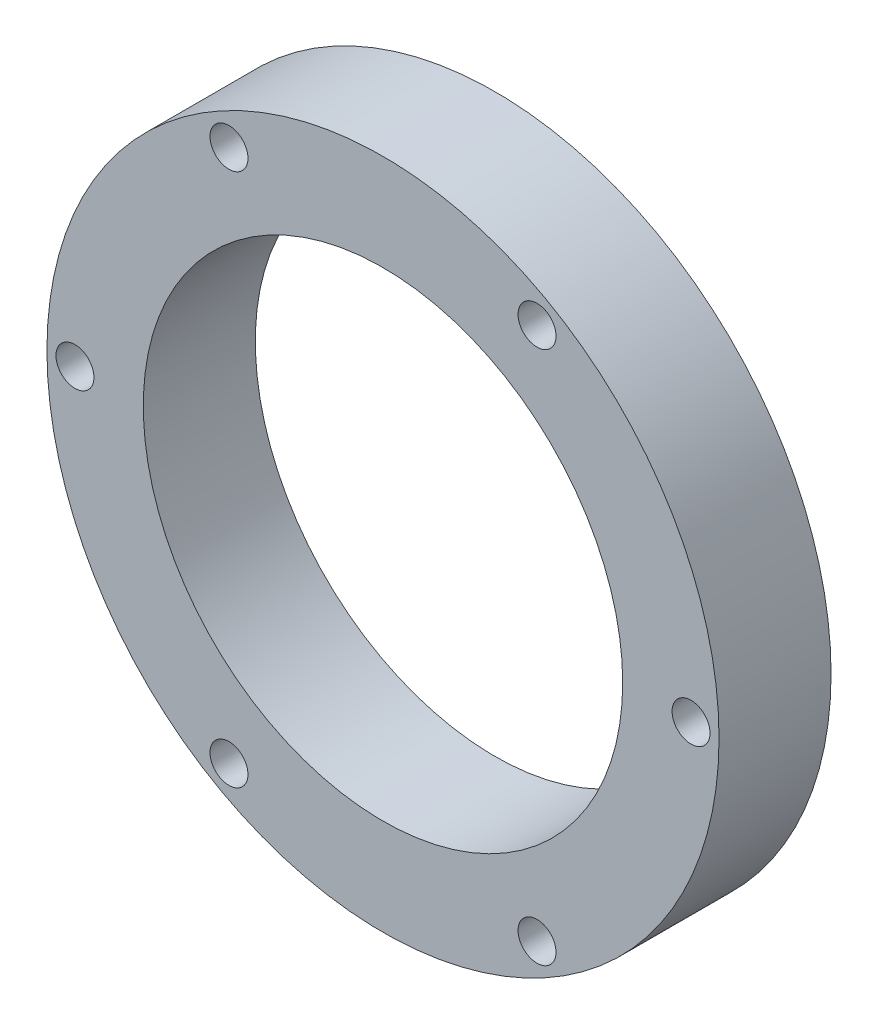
ISO-10303-21;
HEADER;
FILE_DESCRIPTION(('STEP AP214'),'2;1');
FILE_NAME('part.step','',(''),(''),'','','');
FILE_SCHEMA(('AUTOMOTIVE_DESIGN { 1 0 10303 214 1 1 1 1 }'));
ENDSEC;
DATA;
#1=APPLICATION_CONTEXT('core data for automotive mechanical design processes');
#2=APPLICATION_PROTOCOL_DEFINITION('international standard','automotive_design',2000,#1);
#3=PRODUCT_CONTEXT('',#1,'mechanical');
#4=PRODUCT('Part','Part','',(#3));
#5=PRODUCT_RELATED_PRODUCT_CATEGORY('part','',(#4));
#6=PRODUCT_DEFINITION_FORMATION('','',#4);
#7=PRODUCT_DEFINITION_CONTEXT('part definition',#1,'design');
#8=PRODUCT_DEFINITION('design','',#6,#7);
#9=PRODUCT_DEFINITION_SHAPE('','',#8);
#10=(LENGTH_UNIT() NAMED_UNIT(*) SI_UNIT(.MILLI.,.METRE.));
#11=(NAMED_UNIT(*) PLANE_ANGLE_UNIT() SI_UNIT($,.RADIAN.));
#12=(NAMED_UNIT(*) SI_UNIT($,.STERADIAN.) SOLID_ANGLE_UNIT());
#13=UNCERTAINTY_MEASURE_WITH_UNIT(LENGTH_MEASURE(1.E-05),#10,'distance_accuracy_value','');
#14=(GEOMETRIC_REPRESENTATION_CONTEXT(3) GLOBAL_UNCERTAINTY_ASSIGNED_CONTEXT((#13)) GLOBAL_UNIT_ASSIGNED_CONTEXT((#10,
#11,#12)) REPRESENTATION_CONTEXT('',''));
#15=CARTESIAN_POINT('',(0.,0.,0.));
#16=DIRECTION('',(0.,0.,1.));
#17=DIRECTION('',(1.,0.,0.));
#18=AXIS2_PLACEMENT_3D('',#15,#16,#17);
#19=CARTESIAN_POINT('',(0.,0.,0.));
#20=DIRECTION('',(0.,0.,1.));
#21=DIRECTION('',(1.,0.,0.));
#22=AXIS2_PLACEMENT_3D('',#19,#20,#21);
#23=PLANE('',#22);
#24=CARTESIAN_POINT('',(0.,0.,0.));
#25=DIRECTION('',(0.,0.,1.));
#26=DIRECTION('',(1.,0.,0.));
#27=AXIS2_PLACEMENT_3D('',#24,#25,#26);
#28=CIRCLE('',#27,27.178);
#29=CARTESIAN_POINT('',(27.178,0.,0.));
#30=VERTEX_POINT('',#29);
#31=EDGE_CURVE('E52',#30,#30,#28,.T.);
#32=ORIENTED_EDGE('',*,*,#31,.T.);
#33=EDGE_LOOP('',(#32));
#34=FACE_BOUND('',#33,.T.);
#35=CARTESIAN_POINT('',(0.,0.,0.));
#36=DIRECTION('',(0.,0.,-1.));
#37=DIRECTION('',(-1.,0.,0.));
#38=AXIS2_PLACEMENT_3D('',#35,#36,#37);
#39=CIRCLE('',#38,29.1592);
#40=CARTESIAN_POINT('',(-29.1592,0.,0.));
#41=VERTEX_POINT('',#40);
#42=EDGE_CURVE('E116',#41,#41,#39,.T.);
#43=ORIENTED_EDGE('',*,*,#42,.T.);
#44=EDGE_LOOP('',(#43));
#45=FACE_BOUND('',#44,.T.);
#46=ADVANCED_FACE('F37',(#34,#45),#23,.F.);
#47=CARTESIAN_POINT('',(0.,0.,12.7));
#48=DIRECTION('',(0.,0.,1.));
#49=DIRECTION('',(1.,0.,0.));
#50=AXIS2_PLACEMENT_3D('',#47,#48,#49);
#51=PLANE('',#50);
#52=CARTESIAN_POINT('',(-34.925,0.,12.7));
#53=DIRECTION('',(0.,0.,1.));
#54=DIRECTION('',(1.,0.,0.));
#55=AXIS2_PLACEMENT_3D('',#52,#53,#54);
#56=CIRCLE('',#55,2.15265);
#57=CARTESIAN_POINT('',(-32.77235,0.,12.7));
#58=VERTEX_POINT('',#57);
#59=EDGE_CURVE('E103',#58,#58,#56,.T.);
#60=ORIENTED_EDGE('',*,*,#59,.F.);
#61=EDGE_LOOP('',(#60));
#62=FACE_BOUND('',#61,.T.);
#63=CARTESIAN_POINT('',(-17.4625,30.2459372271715,12.7));
#64=DIRECTION('',(0.,0.,1.));
#65=DIRECTION('',(1.,0.,0.));
#66=AXIS2_PLACEMENT_3D('',#63,#64,#65);
#67=CIRCLE('',#66,2.15265);
#68=CARTESIAN_POINT('',(-15.30985,30.2459372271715,12.7));
#69=VERTEX_POINT('',#68);
#70=EDGE_CURVE('E95',#69,#69,#67,.T.);
#71=ORIENTED_EDGE('',*,*,#70,.F.);
#72=EDGE_LOOP('',(#71));
#73=FACE_BOUND('',#72,.T.);
#74=CARTESIAN_POINT('',(17.4625,30.2459372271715,12.7));
#75=DIRECTION('',(0.,0.,1.));
#76=DIRECTION('',(1.,0.,0.));
#77=AXIS2_PLACEMENT_3D('',#74,#75,#76);
#78=CIRCLE('',#77,2.15265);
#79=CARTESIAN_POINT('',(19.61515,30.2459372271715,12.7));
#80=VERTEX_POINT('',#79);
#81=EDGE_CURVE('E87',#80,#80,#78,.T.);
#82=ORIENTED_EDGE('',*,*,#81,.F.);
#83=EDGE_LOOP('',(#82));
#84=FACE_BOUND('',#83,.T.);
#85=CARTESIAN_POINT('',(34.925,0.,12.7));
#86=DIRECTION('',(0.,0.,1.));
#87=DIRECTION('',(1.,0.,0.));
#88=AXIS2_PLACEMENT_3D('',#85,#86,#87);
#89=CIRCLE('',#88,2.15265);
#90=CARTESIAN_POINT('',(37.07765,0.,12.7));
#91=VERTEX_POINT('',#90);
#92=EDGE_CURVE('E79',#91,#91,#89,.T.);
#93=ORIENTED_EDGE('',*,*,#92,.F.);
#94=EDGE_LOOP('',(#93));
#95=FACE_BOUND('',#94,.T.);
#96=CARTESIAN_POINT('',(17.4625,-30.2459372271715,12.7));
#97=DIRECTION('',(0.,0.,1.));
#98=DIRECTION('',(1.,0.,0.));
#99=AXIS2_PLACEMENT_3D('',#96,#97,#98);
#100=CIRCLE('',#99,2.15265);
#101=CARTESIAN_POINT('',(19.61515,-30.2459372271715,12.7));
#102=VERTEX_POINT('',#101);
#103=EDGE_CURVE('E71',#102,#102,#100,.T.);
#104=ORIENTED_EDGE('',*,*,#103,.F.);
#105=EDGE_LOOP('',(#104));
#106=FACE_BOUND('',#105,.T.);
#107=CARTESIAN_POINT('',(-17.4625,-30.2459372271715,12.7));
#108=DIRECTION('',(0.,0.,1.));
#109=DIRECTION('',(1.,0.,0.));
#110=AXIS2_PLACEMENT_3D('',#107,#108,#109);
#111=CIRCLE('',#110,2.15265);
#112=CARTESIAN_POINT('',(-15.30985,-30.2459372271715,12.7));
#113=VERTEX_POINT('',#112);
#114=EDGE_CURVE('E63',#113,#113,#111,.T.);
#115=ORIENTED_EDGE('',*,*,#114,.F.);
#116=EDGE_LOOP('',(#115));
#117=FACE_BOUND('',#116,.T.);
#118=CARTESIAN_POINT('',(0.,0.,12.7));
#119=DIRECTION('',(0.,0.,1.));
#120=DIRECTION('',(1.,0.,0.));
#121=AXIS2_PLACEMENT_3D('',#118,#119,#120);
#122=CIRCLE('',#121,38.1);
#123=CARTESIAN_POINT('',(38.1,0.,12.7));
#124=VERTEX_POINT('',#123);
#125=EDGE_CURVE('E10',#124,#124,#122,.T.);
#126=ORIENTED_EDGE('',*,*,#125,.T.);
#127=EDGE_LOOP('',(#126));
#128=FACE_BOUND('',#127,.T.);
#129=CARTESIAN_POINT('',(0.,0.,12.7));
#130=DIRECTION('',(0.,0.,1.));
#131=DIRECTION('',(1.,0.,0.));
#132=AXIS2_PLACEMENT_3D('',#129,#130,#131);
#133=CIRCLE('',#132,27.178);
#134=CARTESIAN_POINT('',(27.178,0.,12.7));
#135=VERTEX_POINT('',#134);
#136=EDGE_CURVE('E50',#135,#135,#133,.T.);
#137=ORIENTED_EDGE('',*,*,#136,.F.);
#138=EDGE_LOOP('',(#137));
#139=FACE_BOUND('',#138,.T.);
#140=ADVANCED_FACE('F143',(#62,#73,#84,#95,#106,#117,#128,#139),#51,.T.);
#141=CARTESIAN_POINT('',(0.,0.,0.));
#142=DIRECTION('',(0.,0.,-1.));
#143=DIRECTION('',(-1.,0.,0.));
#144=AXIS2_PLACEMENT_3D('',#141,#142,#143);
#145=CIRCLE('',#144,31.8008);
#146=CARTESIAN_POINT('',(-31.8008,0.,0.));
#147=VERTEX_POINT('',#146);
#148=EDGE_CURVE('E108',#147,#147,#145,.T.);
#149=ORIENTED_EDGE('',*,*,#148,.F.);
#150=EDGE_LOOP('',(#149));
#151=FACE_BOUND('',#150,.T.);
#152=CARTESIAN_POINT('',(-34.925,0.,0.));
#153=DIRECTION('',(0.,0.,1.));
#154=DIRECTION('',(1.,0.,0.));
#155=AXIS2_PLACEMENT_3D('',#152,#153,#154);
#156=CIRCLE('',#155,2.15265);
#157=CARTESIAN_POINT('',(-32.77235,0.,0.));
#158=VERTEX_POINT('',#157);
#159=EDGE_CURVE('E99',#158,#158,#156,.T.);
#160=ORIENTED_EDGE('',*,*,#159,.T.);
#161=EDGE_LOOP('',(#160));
#162=FACE_BOUND('',#161,.T.);
#163=CARTESIAN_POINT('',(-17.4625,30.2459372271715,0.));
#164=DIRECTION('',(0.,0.,1.));
#165=DIRECTION('',(1.,0.,0.));
#166=AXIS2_PLACEMENT_3D('',#163,#164,#165);
#167=CIRCLE('',#166,2.15265);
#168=CARTESIAN_POINT('',(-15.30985,30.2459372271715,0.));
#169=VERTEX_POINT('',#168);
#170=EDGE_CURVE('E91',#169,#169,#167,.T.);
#171=ORIENTED_EDGE('',*,*,#170,.T.);
#172=EDGE_LOOP('',(#171));
#173=FACE_BOUND('',#172,.T.);
#174=CARTESIAN_POINT('',(17.4625,30.2459372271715,0.));
#175=DIRECTION('',(0.,0.,1.));
#176=DIRECTION('',(1.,0.,0.));
#177=AXIS2_PLACEMENT_3D('',#174,#175,#176);
#178=CIRCLE('',#177,2.15265);
#179=CARTESIAN_POINT('',(19.61515,30.2459372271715,0.));
#180=VERTEX_POINT('',#179);
#181=EDGE_CURVE('E83',#180,#180,#178,.T.);
#182=ORIENTED_EDGE('',*,*,#181,.T.);
#183=EDGE_LOOP('',(#182));
#184=FACE_BOUND('',#183,.T.);
#185=CARTESIAN_POINT('',(34.925,0.,0.));
#186=DIRECTION('',(0.,0.,1.));
#187=DIRECTION('',(1.,0.,0.));
#188=AXIS2_PLACEMENT_3D('',#185,#186,#187);
#189=CIRCLE('',#188,2.15265);
#190=CARTESIAN_POINT('',(37.07765,0.,0.));
#191=VERTEX_POINT('',#190);
#192=EDGE_CURVE('E75',#191,#191,#189,.T.);
#193=ORIENTED_EDGE('',*,*,#192,.T.);
#194=EDGE_LOOP('',(#193));
#195=FACE_BOUND('',#194,.T.);
#196=CARTESIAN_POINT('',(17.4625,-30.2459372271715,0.));
#197=DIRECTION('',(0.,0.,1.));
#198=DIRECTION('',(1.,0.,0.));
#199=AXIS2_PLACEMENT_3D('',#196,#197,#198);
#200=CIRCLE('',#199,2.15265);
#201=CARTESIAN_POINT('',(19.61515,-30.2459372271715,0.));
#202=VERTEX_POINT('',#201);
#203=EDGE_CURVE('E67',#202,#202,#200,.T.);
#204=ORIENTED_EDGE('',*,*,#203,.T.);
#205=EDGE_LOOP('',(#204));
#206=FACE_BOUND('',#205,.T.);
#207=CARTESIAN_POINT('',(-17.4625,-30.2459372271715,0.));
#208=DIRECTION('',(0.,0.,1.));
#209=DIRECTION('',(1.,0.,0.));
#210=AXIS2_PLACEMENT_3D('',#207,#208,#209);
#211=CIRCLE('',#210,2.15265);
#212=CARTESIAN_POINT('',(-15.30985,-30.2459372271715,0.));
#213=VERTEX_POINT('',#212);
#214=EDGE_CURVE('E56',#213,#213,#211,.T.);
#215=ORIENTED_EDGE('',*,*,#214,.T.);
#216=EDGE_LOOP('',(#215));
#217=FACE_BOUND('',#216,.T.);
#218=CARTESIAN_POINT('',(0.,0.,0.));
#219=DIRECTION('',(0.,0.,1.));
#220=DIRECTION('',(1.,0.,0.));
#221=AXIS2_PLACEMENT_3D('',#218,#219,#220);
#222=CIRCLE('',#221,38.1);
#223=CARTESIAN_POINT('',(38.1,0.,0.));
#224=VERTEX_POINT('',#223);
#225=EDGE_CURVE('E41',#224,#224,#222,.T.);
#226=ORIENTED_EDGE('',*,*,#225,.F.);
#227=EDGE_LOOP('',(#226));
#228=FACE_BOUND('',#227,.T.);
#229=ADVANCED_FACE('F140',(#151,#162,#173,#184,#195,#206,#217,#228),#23,.F.);
#230=CARTESIAN_POINT('',(0.,0.,12.7));
#231=DIRECTION('',(0.,0.,-1.));
#232=DIRECTION('',(-1.,0.,0.));
#233=AXIS2_PLACEMENT_3D('',#230,#231,#232);
#234=CYLINDRICAL_SURFACE('',#233,38.1);
#235=ORIENTED_EDGE('',*,*,#125,.F.);
#236=EDGE_LOOP('',(#235));
#237=FACE_BOUND('',#236,.T.);
#238=ORIENTED_EDGE('',*,*,#225,.T.);
#239=EDGE_LOOP('',(#238));
#240=FACE_BOUND('',#239,.T.);
#241=ADVANCED_FACE('F39',(#237,#240),#234,.T.);
#242=CARTESIAN_POINT('',(0.,0.,12.7));
#243=DIRECTION('',(0.,0.,-1.));
#244=DIRECTION('',(-1.,0.,0.));
#245=AXIS2_PLACEMENT_3D('',#242,#243,#244);
#246=CYLINDRICAL_SURFACE('',#245,27.178);
#247=ORIENTED_EDGE('',*,*,#136,.T.);
#248=EDGE_LOOP('',(#247));
#249=FACE_BOUND('',#248,.T.);
#250=ORIENTED_EDGE('',*,*,#31,.F.);
#251=EDGE_LOOP('',(#250));
#252=FACE_BOUND('',#251,.T.);
#253=ADVANCED_FACE('F159',(#249,#252),#246,.F.);
#254=CARTESIAN_POINT('',(-17.4625,-30.2459372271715,12.7));
#255=DIRECTION('',(0.,0.,1.));
#256=DIRECTION('',(1.,0.,0.));
#257=AXIS2_PLACEMENT_3D('',#254,#255,#256);
#258=CYLINDRICAL_SURFACE('',#257,2.15265);
#259=ORIENTED_EDGE('',*,*,#214,.F.);
#260=EDGE_LOOP('',(#259));
#261=FACE_BOUND('',#260,.T.);
#262=ORIENTED_EDGE('',*,*,#114,.T.);
#263=EDGE_LOOP('',(#262));
#264=FACE_BOUND('',#263,.T.);
#265=ADVANCED_FACE('F164',(#261,#264),#258,.F.);
#266=CARTESIAN_POINT('',(17.4625,-30.2459372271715,12.7));
#267=DIRECTION('',(0.,0.,1.));
#268=DIRECTION('',(1.,0.,0.));
#269=AXIS2_PLACEMENT_3D('',#266,#267,#268);
#270=CYLINDRICAL_SURFACE('',#269,2.15265);
#271=ORIENTED_EDGE('',*,*,#203,.F.);
#272=EDGE_LOOP('',(#271));
#273=FACE_BOUND('',#272,.T.);
#274=ORIENTED_EDGE('',*,*,#103,.T.);
#275=EDGE_LOOP('',(#274));
#276=FACE_BOUND('',#275,.T.);
#277=ADVANCED_FACE('F178',(#273,#276),#270,.F.);
#278=CARTESIAN_POINT('',(34.925,0.,12.7));
#279=DIRECTION('',(0.,0.,1.));
#280=DIRECTION('',(1.,0.,0.));
#281=AXIS2_PLACEMENT_3D('',#278,#279,#280);
#282=CYLINDRICAL_SURFACE('',#281,2.15265);
#283=ORIENTED_EDGE('',*,*,#192,.F.);
#284=EDGE_LOOP('',(#283));
#285=FACE_BOUND('',#284,.T.);
#286=ORIENTED_EDGE('',*,*,#92,.T.);
#287=EDGE_LOOP('',(#286));
#288=FACE_BOUND('',#287,.T.);
#289=ADVANCED_FACE('F182',(#285,#288),#282,.F.);
#290=CARTESIAN_POINT('',(17.4625,30.2459372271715,12.7));
#291=DIRECTION('',(0.,0.,1.));
#292=DIRECTION('',(1.,0.,0.));
#293=AXIS2_PLACEMENT_3D('',#290,#291,#292);
#294=CYLINDRICAL_SURFACE('',#293,2.15265);
#295=ORIENTED_EDGE('',*,*,#181,.F.);
#296=EDGE_LOOP('',(#295));
#297=FACE_BOUND('',#296,.T.);
#298=ORIENTED_EDGE('',*,*,#81,.T.);
#299=EDGE_LOOP('',(#298));
#300=FACE_BOUND('',#299,.T.);
#301=ADVANCED_FACE('F186',(#297,#300),#294,.F.);
#302=CARTESIAN_POINT('',(-17.4625,30.2459372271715,12.7));
#303=DIRECTION('',(0.,0.,1.));
#304=DIRECTION('',(1.,0.,0.));
#305=AXIS2_PLACEMENT_3D('',#302,#303,#304);
#306=CYLINDRICAL_SURFACE('',#305,2.15265);
#307=ORIENTED_EDGE('',*,*,#170,.F.);
#308=EDGE_LOOP('',(#307));
#309=FACE_BOUND('',#308,.T.);
#310=ORIENTED_EDGE('',*,*,#70,.T.);
#311=EDGE_LOOP('',(#310));
#312=FACE_BOUND('',#311,.T.);
#313=ADVANCED_FACE('F190',(#309,#312),#306,.F.);
#314=CARTESIAN_POINT('',(-34.925,0.,12.7));
#315=DIRECTION('',(0.,0.,1.));
#316=DIRECTION('',(1.,0.,0.));
#317=AXIS2_PLACEMENT_3D('',#314,#315,#316);
#318=CYLINDRICAL_SURFACE('',#317,2.15265);
#319=ORIENTED_EDGE('',*,*,#159,.F.);
#320=EDGE_LOOP('',(#319));
#321=FACE_BOUND('',#320,.T.);
#322=ORIENTED_EDGE('',*,*,#59,.T.);
#323=EDGE_LOOP('',(#322));
#324=FACE_BOUND('',#323,.T.);
#325=ADVANCED_FACE('F136',(#321,#324),#318,.F.);
#326=CARTESIAN_POINT('',(0.,0.,1.3208));
#327=DIRECTION('',(0.,0.,-1.));
#328=DIRECTION('',(-1.,0.,0.));
#329=AXIS2_PLACEMENT_3D('',#326,#327,#328);
#330=CYLINDRICAL_SURFACE('',#329,31.8008);
#331=CARTESIAN_POINT('',(0.,0.,1.3208));
#332=DIRECTION('',(0.,0.,-1.));
#333=DIRECTION('',(-1.,0.,0.));
#334=AXIS2_PLACEMENT_3D('',#331,#332,#333);
#335=CIRCLE('',#334,31.8008);
#336=CARTESIAN_POINT('',(-31.8008,0.,1.3208));
#337=VERTEX_POINT('',#336);
#338=EDGE_CURVE('E107',#337,#337,#335,.T.);
#339=ORIENTED_EDGE('',*,*,#338,.F.);
#340=EDGE_LOOP('',(#339));
#341=FACE_BOUND('',#340,.T.);
#342=ORIENTED_EDGE('',*,*,#148,.T.);
#343=EDGE_LOOP('',(#342));
#344=FACE_BOUND('',#343,.T.);
#345=ADVANCED_FACE('F130',(#341,#344),#330,.F.);
#346=CARTESIAN_POINT('',(0.,0.,1.3208));
#347=DIRECTION('',(0.,0.,-1.));
#348=DIRECTION('',(-1.,0.,0.));
#349=AXIS2_PLACEMENT_3D('',#346,#347,#348);
#350=PLANE('',#349);
#351=CARTESIAN_POINT('',(0.,0.,1.3208));
#352=DIRECTION('',(0.,0.,-1.));
#353=DIRECTION('',(-1.,0.,0.));
#354=AXIS2_PLACEMENT_3D('',#351,#352,#353);
#355=CIRCLE('',#354,29.1592);
#356=CARTESIAN_POINT('',(-29.1592,0.,1.3208));
#357=VERTEX_POINT('',#356);
#358=EDGE_CURVE('E112',#357,#357,#355,.T.);
#359=ORIENTED_EDGE('',*,*,#358,.F.);
#360=EDGE_LOOP('',(#359));
#361=FACE_BOUND('',#360,.T.);
#362=ORIENTED_EDGE('',*,*,#338,.T.);
#363=EDGE_LOOP('',(#362));
#364=FACE_BOUND('',#363,.T.);
#365=ADVANCED_FACE('F127',(#361,#364),#350,.T.);
#366=CARTESIAN_POINT('',(0.,0.,1.3208));
#367=DIRECTION('',(0.,0.,-1.));
#368=DIRECTION('',(-1.,0.,0.));
#369=AXIS2_PLACEMENT_3D('',#366,#367,#368);
#370=CYLINDRICAL_SURFACE('',#369,29.1592);
#371=ORIENTED_EDGE('',*,*,#358,.T.);
#372=EDGE_LOOP('',(#371));
#373=FACE_BOUND('',#372,.T.);
#374=ORIENTED_EDGE('',*,*,#42,.F.);
#375=EDGE_LOOP('',(#374));
#376=FACE_BOUND('',#375,.T.);
#377=ADVANCED_FACE('F124',(#373,#376),#370,.T.);
#378=CLOSED_SHELL('',(#46,#140,#229,#241,#253,#265,#277,#289,#301,#313,#325,#345,#365,#377));
#379=MANIFOLD_SOLID_BREP('B2',#378);
#380=ADVANCED_BREP_SHAPE_REPRESENTATION('',(#18,#379),#14);
#381=SHAPE_DEFINITION_REPRESENTATION(#9,#380);
ENDSEC;
END-ISO-10303-21;
